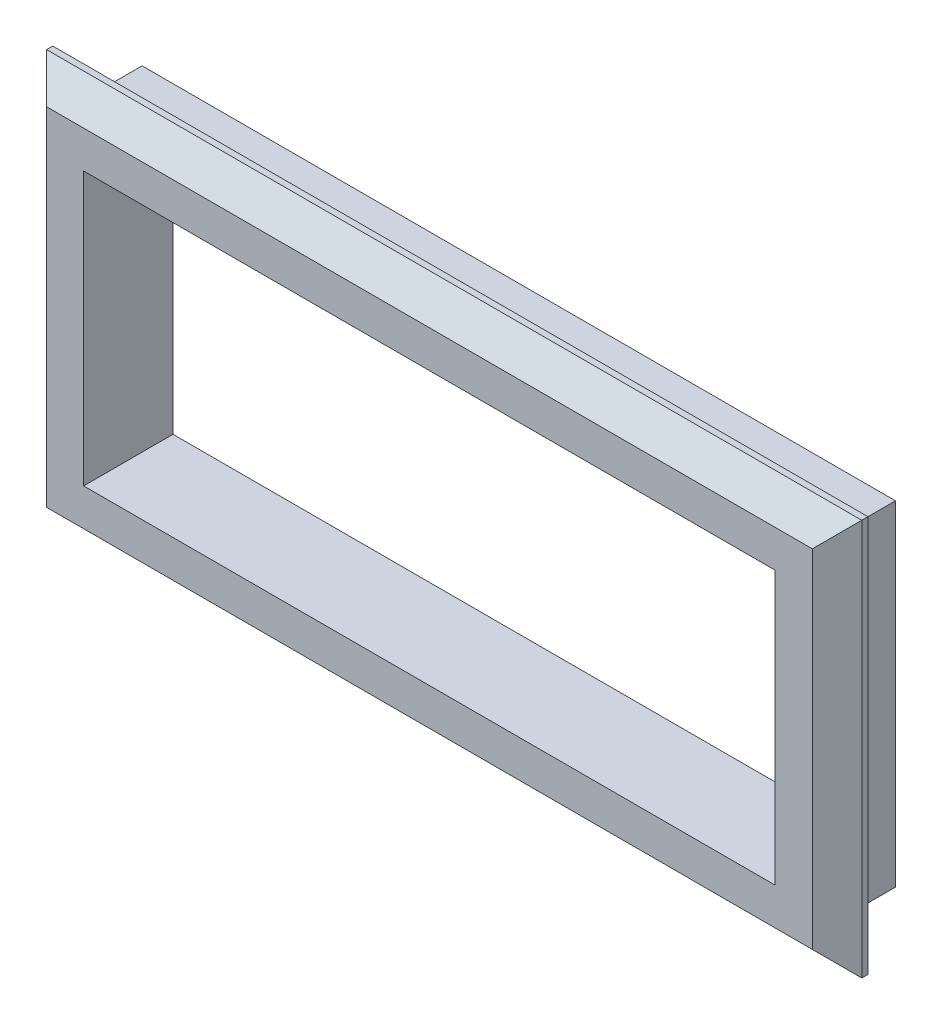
from build123d import *

# Parameters (mm, degrees)
SKETCH1_W           = 77.35
SKETCH1_H           = 34.35
SKETCH1_W_2         = 71
SKETCH1_H_2         = 28
BOSS_EXTRUDE1_DEPTH = 6
SKETCH2_W           = 83.7
SKETCH2_H           = 40.7
SKETCH2_W_2         = 71
SKETCH2_H_2         = 28
BOSS_EXTRUDE2_DEPTH = 3.175
CHAMFER1_SIZE       = 2.54


with BuildPart() as part:
    # Sketch1 → Boss-Extrude1 (new body)
    with BuildSketch(Plane.XY):
        with Locations((35.5, 14)):
            Rectangle(SKETCH1_W, SKETCH1_H)
        with Locations((35.5, 14)):
            Rectangle(SKETCH1_W_2, SKETCH1_H_2, mode=Mode.SUBTRACT)
    extrude(amount=BOSS_EXTRUDE1_DEPTH)

    # Sketch2 → Boss-Extrude2 (add)
    with BuildSketch(Plane.XY.offset(6)):
        with Locations((35.5, 14)):
            Rectangle(SKETCH2_W, SKETCH2_H)
        with Locations((35.5, 14)):
            Rectangle(SKETCH2_W_2, SKETCH2_H_2, mode=Mode.SUBTRACT)
    extrude(amount=BOSS_EXTRUDE2_DEPTH)

    # Chamfer1
    chamfer1_edges = [part.edges().sort_by_distance(p)[0] for p in [
        (-6.35, 14, 9.175),
        (35.5, -6.35, 9.175),
        (77.35, 14, 9.175),
        (35.5, 34.35, 9.175),
    ]]
    chamfer(chamfer1_edges, length=CHAMFER1_SIZE)


solid = part.part
